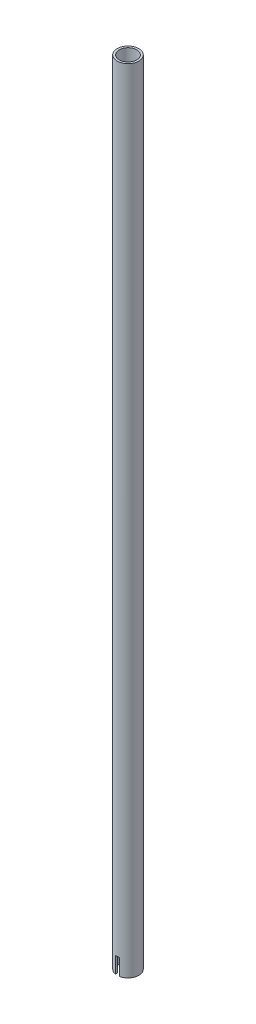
ISO-10303-21;
HEADER;
FILE_DESCRIPTION(('STEP AP214'),'2;1');
FILE_NAME('part.step','',(''),(''),'','','');
FILE_SCHEMA(('AUTOMOTIVE_DESIGN { 1 0 10303 214 1 1 1 1 }'));
ENDSEC;
DATA;
#1=APPLICATION_CONTEXT('core data for automotive mechanical design processes');
#2=APPLICATION_PROTOCOL_DEFINITION('international standard','automotive_design',2000,#1);
#3=PRODUCT_CONTEXT('',#1,'mechanical');
#4=PRODUCT('Part','Part','',(#3));
#5=PRODUCT_RELATED_PRODUCT_CATEGORY('part','',(#4));
#6=PRODUCT_DEFINITION_FORMATION('','',#4);
#7=PRODUCT_DEFINITION_CONTEXT('part definition',#1,'design');
#8=PRODUCT_DEFINITION('design','',#6,#7);
#9=PRODUCT_DEFINITION_SHAPE('','',#8);
#10=(LENGTH_UNIT() NAMED_UNIT(*) SI_UNIT(.MILLI.,.METRE.));
#11=(NAMED_UNIT(*) PLANE_ANGLE_UNIT() SI_UNIT($,.RADIAN.));
#12=(NAMED_UNIT(*) SI_UNIT($,.STERADIAN.) SOLID_ANGLE_UNIT());
#13=UNCERTAINTY_MEASURE_WITH_UNIT(LENGTH_MEASURE(1.E-05),#10,'distance_accuracy_value','');
#14=(GEOMETRIC_REPRESENTATION_CONTEXT(3) GLOBAL_UNCERTAINTY_ASSIGNED_CONTEXT((#13)) GLOBAL_UNIT_ASSIGNED_CONTEXT((#10,
#11,#12)) REPRESENTATION_CONTEXT('',''));
#15=CARTESIAN_POINT('',(0.,0.,0.));
#16=DIRECTION('',(0.,0.,1.));
#17=DIRECTION('',(1.,0.,0.));
#18=AXIS2_PLACEMENT_3D('',#15,#16,#17);
#19=CARTESIAN_POINT('',(0.,-1219.2,0.));
#20=DIRECTION('',(0.,1.,0.));
#21=DIRECTION('',(0.,0.,1.));
#22=AXIS2_PLACEMENT_3D('',#19,#20,#21);
#23=PLANE('',#22);
#24=CARTESIAN_POINT('',(0.,-1219.2,0.));
#25=DIRECTION('',(0.,1.,0.));
#26=DIRECTION('',(0.,0.,1.));
#27=AXIS2_PLACEMENT_3D('',#24,#25,#26);
#28=CIRCLE('',#27,16.6624);
#29=CARTESIAN_POINT('',(-3.175,-1219.2,-16.3571069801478));
#30=VERTEX_POINT('',#29);
#31=CARTESIAN_POINT('',(-3.175,-1219.2,16.3571069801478));
#32=VERTEX_POINT('',#31);
#33=EDGE_CURVE('E138',#30,#32,#28,.T.);
#34=ORIENTED_EDGE('',*,*,#33,.F.);
#35=DIRECTION('',(0.,0.,1.));
#36=VECTOR('',#35,1.);
#37=CARTESIAN_POINT('',(-3.175,-1219.2,0.));
#38=LINE('',#37,#36);
#39=CARTESIAN_POINT('',(-3.175,-1219.2,-13.1083688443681));
#40=VERTEX_POINT('',#39);
#41=EDGE_CURVE('E102',#30,#40,#38,.T.);
#42=ORIENTED_EDGE('',*,*,#41,.T.);
#43=CARTESIAN_POINT('',(0.,-1219.2,0.));
#44=DIRECTION('',(0.,1.,0.));
#45=DIRECTION('',(0.,0.,1.));
#46=AXIS2_PLACEMENT_3D('',#43,#44,#45);
#47=CIRCLE('',#46,13.4874);
#48=CARTESIAN_POINT('',(-3.175,-1219.2,13.1083688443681));
#49=VERTEX_POINT('',#48);
#50=EDGE_CURVE('E131',#40,#49,#47,.T.);
#51=ORIENTED_EDGE('',*,*,#50,.T.);
#52=EDGE_CURVE('E124',#49,#32,#38,.T.);
#53=ORIENTED_EDGE('',*,*,#52,.T.);
#54=EDGE_LOOP('',(#34,#42,#51,#53));
#55=FACE_BOUND('',#54,.T.);
#56=ADVANCED_FACE('F26',(#55),#23,.F.);
#57=CARTESIAN_POINT('',(0.,-1219.2,0.));
#58=DIRECTION('',(0.,1.,0.));
#59=DIRECTION('',(0.,0.,1.));
#60=AXIS2_PLACEMENT_3D('',#57,#58,#59);
#61=CYLINDRICAL_SURFACE('',#60,16.6624);
#62=DIRECTION('',(0.,1.,0.));
#63=VECTOR('',#62,1.);
#64=CARTESIAN_POINT('',(-3.175,-1219.2,-16.3571069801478));
#65=LINE('',#64,#63);
#66=CARTESIAN_POINT('',(-3.175,-1193.8,-16.3571069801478));
#67=VERTEX_POINT('',#66);
#68=EDGE_CURVE('E123',#30,#67,#65,.T.);
#69=ORIENTED_EDGE('',*,*,#68,.F.);
#70=ORIENTED_EDGE('',*,*,#33,.T.);
#71=DIRECTION('',(0.,1.,0.));
#72=VECTOR('',#71,1.);
#73=CARTESIAN_POINT('',(-3.175,-1219.2,16.3571069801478));
#74=LINE('',#73,#72);
#75=CARTESIAN_POINT('',(-3.175,-1193.8,16.3571069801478));
#76=VERTEX_POINT('',#75);
#77=EDGE_CURVE('E126',#76,#32,#74,.F.);
#78=ORIENTED_EDGE('',*,*,#77,.F.);
#79=CARTESIAN_POINT('',(0.,-1193.8,0.));
#80=DIRECTION('',(0.,1.,0.));
#81=DIRECTION('',(0.,0.,1.));
#82=AXIS2_PLACEMENT_3D('',#79,#80,#81);
#83=CIRCLE('',#82,16.6624);
#84=CARTESIAN_POINT('',(3.175,-1193.8,16.3571069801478));
#85=VERTEX_POINT('',#84);
#86=EDGE_CURVE('E103',#85,#76,#83,.F.);
#87=ORIENTED_EDGE('',*,*,#86,.F.);
#88=DIRECTION('',(0.,1.,0.));
#89=VECTOR('',#88,1.);
#90=CARTESIAN_POINT('',(3.175,-1219.2,16.3571069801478));
#91=LINE('',#90,#89);
#92=CARTESIAN_POINT('',(3.175,-1219.2,16.3571069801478));
#93=VERTEX_POINT('',#92);
#94=EDGE_CURVE('E116',#93,#85,#91,.T.);
#95=ORIENTED_EDGE('',*,*,#94,.F.);
#96=CARTESIAN_POINT('',(3.175,-1219.2,-16.3571069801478));
#97=VERTEX_POINT('',#96);
#98=EDGE_CURVE('E114',#93,#97,#28,.T.);
#99=ORIENTED_EDGE('',*,*,#98,.T.);
#100=DIRECTION('',(0.,1.,0.));
#101=VECTOR('',#100,1.);
#102=CARTESIAN_POINT('',(3.175,-1219.2,-16.3571069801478));
#103=LINE('',#102,#101);
#104=CARTESIAN_POINT('',(3.175,-1193.8,-16.3571069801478));
#105=VERTEX_POINT('',#104);
#106=EDGE_CURVE('E106',#105,#97,#103,.F.);
#107=ORIENTED_EDGE('',*,*,#106,.F.);
#108=EDGE_CURVE('E92',#67,#105,#83,.F.);
#109=ORIENTED_EDGE('',*,*,#108,.F.);
#110=EDGE_LOOP('',(#69,#70,#78,#87,#95,#99,#107,#109));
#111=FACE_BOUND('',#110,.T.);
#112=CARTESIAN_POINT('',(0.,0.,0.));
#113=DIRECTION('',(0.,1.,0.));
#114=DIRECTION('',(0.,0.,1.));
#115=AXIS2_PLACEMENT_3D('',#112,#113,#114);
#116=CIRCLE('',#115,16.6624);
#117=CARTESIAN_POINT('',(0.,0.,16.6624));
#118=VERTEX_POINT('',#117);
#119=EDGE_CURVE('E135',#118,#118,#116,.T.);
#120=ORIENTED_EDGE('',*,*,#119,.F.);
#121=EDGE_LOOP('',(#120));
#122=FACE_BOUND('',#121,.T.);
#123=ADVANCED_FACE('F28',(#111,#122),#61,.T.);
#124=ORIENTED_EDGE('',*,*,#98,.F.);
#125=DIRECTION('',(0.,0.,-1.));
#126=VECTOR('',#125,1.);
#127=CARTESIAN_POINT('',(3.175,-1219.2,0.));
#128=LINE('',#127,#126);
#129=CARTESIAN_POINT('',(3.175,-1219.2,13.1083688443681));
#130=VERTEX_POINT('',#129);
#131=EDGE_CURVE('E118',#93,#130,#128,.T.);
#132=ORIENTED_EDGE('',*,*,#131,.T.);
#133=CARTESIAN_POINT('',(3.175,-1219.2,-13.1083688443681));
#134=VERTEX_POINT('',#133);
#135=EDGE_CURVE('E132',#130,#134,#47,.T.);
#136=ORIENTED_EDGE('',*,*,#135,.T.);
#137=EDGE_CURVE('E49',#134,#97,#128,.T.);
#138=ORIENTED_EDGE('',*,*,#137,.T.);
#139=EDGE_LOOP('',(#124,#132,#136,#138));
#140=FACE_BOUND('',#139,.T.);
#141=ADVANCED_FACE('F172',(#140),#23,.F.);
#142=CARTESIAN_POINT('',(0.,0.,0.));
#143=DIRECTION('',(0.,1.,0.));
#144=DIRECTION('',(0.,0.,1.));
#145=AXIS2_PLACEMENT_3D('',#142,#143,#144);
#146=PLANE('',#145);
#147=CARTESIAN_POINT('',(0.,0.,0.));
#148=DIRECTION('',(0.,1.,0.));
#149=DIRECTION('',(0.,0.,1.));
#150=AXIS2_PLACEMENT_3D('',#147,#148,#149);
#151=CIRCLE('',#150,13.4874);
#152=CARTESIAN_POINT('',(0.,0.,13.4874));
#153=VERTEX_POINT('',#152);
#154=EDGE_CURVE('E128',#153,#153,#151,.T.);
#155=ORIENTED_EDGE('',*,*,#154,.F.);
#156=EDGE_LOOP('',(#155));
#157=FACE_BOUND('',#156,.T.);
#158=ORIENTED_EDGE('',*,*,#119,.T.);
#159=EDGE_LOOP('',(#158));
#160=FACE_BOUND('',#159,.T.);
#161=ADVANCED_FACE('F174',(#157,#160),#146,.T.);
#162=CARTESIAN_POINT('',(0.,-1219.2,0.));
#163=DIRECTION('',(0.,1.,0.));
#164=DIRECTION('',(0.,0.,1.));
#165=AXIS2_PLACEMENT_3D('',#162,#163,#164);
#166=CYLINDRICAL_SURFACE('',#165,13.4874);
#167=ORIENTED_EDGE('',*,*,#50,.F.);
#168=DIRECTION('',(0.,1.,0.));
#169=VECTOR('',#168,1.);
#170=CARTESIAN_POINT('',(-3.175,-1219.2,-13.1083688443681));
#171=LINE('',#170,#169);
#172=CARTESIAN_POINT('',(-3.175,-1193.8,-13.1083688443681));
#173=VERTEX_POINT('',#172);
#174=EDGE_CURVE('E11',#40,#173,#171,.T.);
#175=ORIENTED_EDGE('',*,*,#174,.T.);
#176=CARTESIAN_POINT('',(0.,-1193.8,0.));
#177=DIRECTION('',(0.,1.,0.));
#178=DIRECTION('',(0.,0.,1.));
#179=AXIS2_PLACEMENT_3D('',#176,#177,#178);
#180=CIRCLE('',#179,13.4874);
#181=CARTESIAN_POINT('',(3.175,-1193.8,-13.1083688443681));
#182=VERTEX_POINT('',#181);
#183=EDGE_CURVE('E34',#173,#182,#180,.F.);
#184=ORIENTED_EDGE('',*,*,#183,.T.);
#185=DIRECTION('',(0.,1.,0.));
#186=VECTOR('',#185,1.);
#187=CARTESIAN_POINT('',(3.175,-1219.2,-13.1083688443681));
#188=LINE('',#187,#186);
#189=EDGE_CURVE('E107',#182,#134,#188,.F.);
#190=ORIENTED_EDGE('',*,*,#189,.T.);
#191=ORIENTED_EDGE('',*,*,#135,.F.);
#192=DIRECTION('',(0.,1.,0.));
#193=VECTOR('',#192,1.);
#194=CARTESIAN_POINT('',(3.175,-1219.2,13.1083688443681));
#195=LINE('',#194,#193);
#196=CARTESIAN_POINT('',(3.175,-1193.8,13.1083688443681));
#197=VERTEX_POINT('',#196);
#198=EDGE_CURVE('E140',#130,#197,#195,.T.);
#199=ORIENTED_EDGE('',*,*,#198,.T.);
#200=CARTESIAN_POINT('',(-3.175,-1193.8,13.1083688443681));
#201=VERTEX_POINT('',#200);
#202=EDGE_CURVE('E143',#197,#201,#180,.F.);
#203=ORIENTED_EDGE('',*,*,#202,.T.);
#204=DIRECTION('',(0.,1.,0.));
#205=VECTOR('',#204,1.);
#206=CARTESIAN_POINT('',(-3.175,-1219.2,13.1083688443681));
#207=LINE('',#206,#205);
#208=EDGE_CURVE('E146',#201,#49,#207,.F.);
#209=ORIENTED_EDGE('',*,*,#208,.T.);
#210=EDGE_LOOP('',(#167,#175,#184,#190,#191,#199,#203,#209));
#211=FACE_BOUND('',#210,.T.);
#212=ORIENTED_EDGE('',*,*,#154,.T.);
#213=EDGE_LOOP('',(#212));
#214=FACE_BOUND('',#213,.T.);
#215=ADVANCED_FACE('F151',(#211,#214),#166,.F.);
#216=CARTESIAN_POINT('',(3.175,-1528.00369421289,-19.05));
#217=DIRECTION('',(1.,0.,0.));
#218=DIRECTION('',(0.,0.,-1.));
#219=AXIS2_PLACEMENT_3D('',#216,#217,#218);
#220=PLANE('',#219);
#221=ORIENTED_EDGE('',*,*,#94,.T.);
#222=DIRECTION('',(0.,0.,1.));
#223=VECTOR('',#222,1.);
#224=CARTESIAN_POINT('',(3.175,-1193.8,-19.05));
#225=LINE('',#224,#223);
#226=EDGE_CURVE('E41',#197,#85,#225,.T.);
#227=ORIENTED_EDGE('',*,*,#226,.F.);
#228=ORIENTED_EDGE('',*,*,#198,.F.);
#229=ORIENTED_EDGE('',*,*,#131,.F.);
#230=EDGE_LOOP('',(#221,#227,#228,#229));
#231=FACE_BOUND('',#230,.T.);
#232=ADVANCED_FACE('F170',(#231),#220,.F.);
#233=CARTESIAN_POINT('',(-3.175,-1193.8,-19.05));
#234=DIRECTION('',(0.,1.,0.));
#235=DIRECTION('',(0.,0.,1.));
#236=AXIS2_PLACEMENT_3D('',#233,#234,#235);
#237=PLANE('',#236);
#238=ORIENTED_EDGE('',*,*,#86,.T.);
#239=DIRECTION('',(0.,0.,1.));
#240=VECTOR('',#239,1.);
#241=CARTESIAN_POINT('',(-3.175,-1193.8,-19.05));
#242=LINE('',#241,#240);
#243=EDGE_CURVE('E108',#201,#76,#242,.T.);
#244=ORIENTED_EDGE('',*,*,#243,.F.);
#245=ORIENTED_EDGE('',*,*,#202,.F.);
#246=ORIENTED_EDGE('',*,*,#226,.T.);
#247=EDGE_LOOP('',(#238,#244,#245,#246));
#248=FACE_BOUND('',#247,.T.);
#249=ADVANCED_FACE('F160',(#248),#237,.F.);
#250=CARTESIAN_POINT('',(-3.175,-1528.00369421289,-19.05));
#251=DIRECTION('',(-1.,0.,0.));
#252=DIRECTION('',(0.,0.,1.));
#253=AXIS2_PLACEMENT_3D('',#250,#251,#252);
#254=PLANE('',#253);
#255=ORIENTED_EDGE('',*,*,#77,.T.);
#256=ORIENTED_EDGE('',*,*,#52,.F.);
#257=ORIENTED_EDGE('',*,*,#208,.F.);
#258=ORIENTED_EDGE('',*,*,#243,.T.);
#259=EDGE_LOOP('',(#255,#256,#257,#258));
#260=FACE_BOUND('',#259,.T.);
#261=ADVANCED_FACE('F167',(#260),#254,.F.);
#262=ORIENTED_EDGE('',*,*,#108,.T.);
#263=EDGE_CURVE('E95',#105,#182,#225,.T.);
#264=ORIENTED_EDGE('',*,*,#263,.T.);
#265=ORIENTED_EDGE('',*,*,#183,.F.);
#266=EDGE_CURVE('E98',#67,#173,#242,.T.);
#267=ORIENTED_EDGE('',*,*,#266,.F.);
#268=EDGE_LOOP('',(#262,#264,#265,#267));
#269=FACE_BOUND('',#268,.T.);
#270=ADVANCED_FACE('F94',(#269),#237,.F.);
#271=ORIENTED_EDGE('',*,*,#106,.T.);
#272=ORIENTED_EDGE('',*,*,#137,.F.);
#273=ORIENTED_EDGE('',*,*,#189,.F.);
#274=ORIENTED_EDGE('',*,*,#263,.F.);
#275=EDGE_LOOP('',(#271,#272,#273,#274));
#276=FACE_BOUND('',#275,.T.);
#277=ADVANCED_FACE('F105',(#276),#220,.F.);
#278=ORIENTED_EDGE('',*,*,#68,.T.);
#279=ORIENTED_EDGE('',*,*,#266,.T.);
#280=ORIENTED_EDGE('',*,*,#174,.F.);
#281=ORIENTED_EDGE('',*,*,#41,.F.);
#282=EDGE_LOOP('',(#278,#279,#280,#281));
#283=FACE_BOUND('',#282,.T.);
#284=ADVANCED_FACE('F154',(#283),#254,.F.);
#285=CLOSED_SHELL('',(#56,#123,#141,#161,#215,#232,#249,#261,#270,#277,#284));
#286=MANIFOLD_SOLID_BREP('B2',#285);
#287=ADVANCED_BREP_SHAPE_REPRESENTATION('',(#18,#286),#14);
#288=SHAPE_DEFINITION_REPRESENTATION(#9,#287);
ENDSEC;
END-ISO-10303-21;
